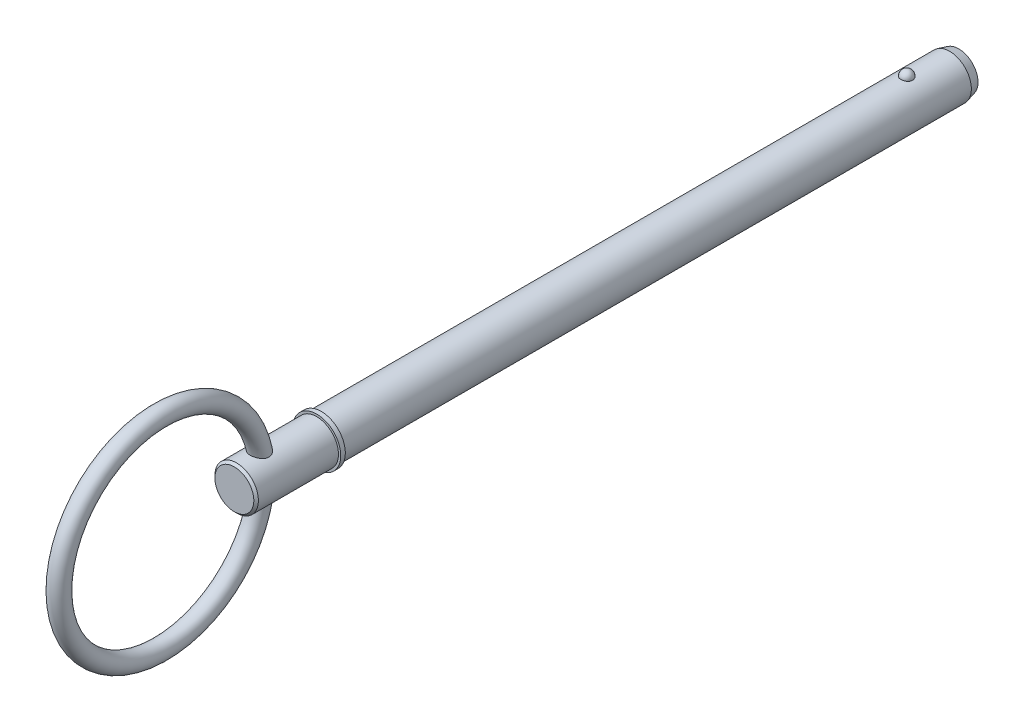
ISO-10303-21;
HEADER;
FILE_DESCRIPTION(('STEP AP214'),'2;1');
FILE_NAME('part.step','',(''),(''),'','','');
FILE_SCHEMA(('AUTOMOTIVE_DESIGN { 1 0 10303 214 1 1 1 1 }'));
ENDSEC;
DATA;
#1=APPLICATION_CONTEXT('core data for automotive mechanical design processes');
#2=APPLICATION_PROTOCOL_DEFINITION('international standard','automotive_design',2000,#1);
#3=PRODUCT_CONTEXT('',#1,'mechanical');
#4=PRODUCT('Part','Part','',(#3));
#5=PRODUCT_RELATED_PRODUCT_CATEGORY('part','',(#4));
#6=PRODUCT_DEFINITION_FORMATION('','',#4);
#7=PRODUCT_DEFINITION_CONTEXT('part definition',#1,'design');
#8=PRODUCT_DEFINITION('design','',#6,#7);
#9=PRODUCT_DEFINITION_SHAPE('','',#8);
#10=(LENGTH_UNIT() NAMED_UNIT(*) SI_UNIT(.MILLI.,.METRE.));
#11=(NAMED_UNIT(*) PLANE_ANGLE_UNIT() SI_UNIT($,.RADIAN.));
#12=(NAMED_UNIT(*) SI_UNIT($,.STERADIAN.) SOLID_ANGLE_UNIT());
#13=UNCERTAINTY_MEASURE_WITH_UNIT(LENGTH_MEASURE(1.E-05),#10,'distance_accuracy_value','');
#14=(GEOMETRIC_REPRESENTATION_CONTEXT(3) GLOBAL_UNCERTAINTY_ASSIGNED_CONTEXT((#13)) GLOBAL_UNIT_ASSIGNED_CONTEXT((#10,
#11,#12)) REPRESENTATION_CONTEXT('',''));
#15=CARTESIAN_POINT('',(0.,0.,0.));
#16=DIRECTION('',(0.,0.,1.));
#17=DIRECTION('',(1.,0.,0.));
#18=AXIS2_PLACEMENT_3D('',#15,#16,#17);
#19=CARTESIAN_POINT('',(0.,0.,127.));
#20=DIRECTION('',(0.,0.,-1.));
#21=DIRECTION('',(-1.,0.,0.));
#22=AXIS2_PLACEMENT_3D('',#19,#20,#21);
#23=CYLINDRICAL_SURFACE('',#22,4.765);
#24=CARTESIAN_POINT('',(1.27812710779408,4.59038300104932,-1.28999999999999));
#25=CARTESIAN_POINT('',(1.27812572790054,4.59038414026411,-1.21786886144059));
#26=CARTESIAN_POINT('',(1.27223018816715,4.59203736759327,-1.14572000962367));
#27=CARTESIAN_POINT('',(1.24878929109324,4.59846646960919,-1.00346315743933));
#28=CARTESIAN_POINT('',(1.23123896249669,4.60324367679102,-0.933356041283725));
#29=CARTESIAN_POINT('',(1.18493861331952,4.61537801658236,-0.797215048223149));
#30=CARTESIAN_POINT('',(1.15619354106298,4.62273400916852,-0.731179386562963));
#31=CARTESIAN_POINT('',(1.08822596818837,4.6392032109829,-0.604986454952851));
#32=CARTESIAN_POINT('',(1.04900384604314,4.64831635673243,-0.544828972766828));
#33=CARTESIAN_POINT('',(0.960865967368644,4.66733302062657,-0.431775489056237));
#34=CARTESIAN_POINT('',(0.911906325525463,4.67723999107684,-0.378914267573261));
#35=CARTESIAN_POINT('',(0.805678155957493,4.69670280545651,-0.282245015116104));
#36=CARTESIAN_POINT('',(0.748409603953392,4.70625864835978,-0.238437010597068));
#37=CARTESIAN_POINT('',(0.627266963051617,4.72392767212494,-0.161207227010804));
#38=CARTESIAN_POINT('',(0.563411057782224,4.73204466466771,-0.127757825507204));
#39=CARTESIAN_POINT('',(0.430755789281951,4.74595788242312,-0.0720471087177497));
#40=CARTESIAN_POINT('',(0.361956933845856,4.75175434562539,-0.0497846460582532));
#41=CARTESIAN_POINT('',(0.222605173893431,4.76030056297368,-0.0173750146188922));
#42=CARTESIAN_POINT('',(0.152101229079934,4.76309991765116,-0.00703038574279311));
#43=CARTESIAN_POINT('',(0.0103009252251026,4.76551622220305,0.00191361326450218));
#44=CARTESIAN_POINT('',(-0.0609953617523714,4.76513345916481,0.000514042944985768));
#45=CARTESIAN_POINT('',(-0.201348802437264,4.76125496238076,-0.0138891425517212));
#46=CARTESIAN_POINT('',(-0.270423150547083,4.75780093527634,-0.0267372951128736));
#47=CARTESIAN_POINT('',(-0.405377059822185,4.74820737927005,-0.0634598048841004));
#48=CARTESIAN_POINT('',(-0.471256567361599,4.74206780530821,-0.0873343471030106));
#49=CARTESIAN_POINT('',(-0.598375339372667,4.72771507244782,-0.145611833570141));
#50=CARTESIAN_POINT('',(-0.659587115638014,4.71949070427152,-0.180071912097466));
#51=CARTESIAN_POINT('',(-0.775356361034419,4.70185936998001,-0.258542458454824));
#52=CARTESIAN_POINT('',(-0.8299131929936,4.69245229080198,-0.302553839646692));
#53=CARTESIAN_POINT('',(-0.931895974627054,4.67327936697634,-0.399829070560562));
#54=CARTESIAN_POINT('',(-0.979176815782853,4.66351011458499,-0.453244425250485));
#55=CARTESIAN_POINT('',(-1.06421220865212,4.64484426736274,-0.567321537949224));
#56=CARTESIAN_POINT('',(-1.10196613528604,4.63594772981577,-0.627983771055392));
#57=CARTESIAN_POINT('',(-1.16735225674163,4.61992036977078,-0.755585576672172));
#58=CARTESIAN_POINT('',(-1.19487251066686,4.61280933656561,-0.822585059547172));
#59=CARTESIAN_POINT('',(-1.23851975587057,4.60128324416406,-0.960417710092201));
#60=CARTESIAN_POINT('',(-1.25464705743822,4.59686811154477,-1.03125077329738));
#61=CARTESIAN_POINT('',(-1.27505790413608,4.59124882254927,-1.17443804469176));
#62=CARTESIAN_POINT('',(-1.27938868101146,4.59003186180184,-1.246785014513));
#63=CARTESIAN_POINT('',(-1.27623192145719,4.5909105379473,-1.39119892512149));
#64=CARTESIAN_POINT('',(-1.26874468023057,4.59300609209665,-1.46326587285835));
#65=CARTESIAN_POINT('',(-1.24220427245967,4.60025423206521,-1.60473192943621));
#66=CARTESIAN_POINT('',(-1.2232043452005,4.60539274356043,-1.67414176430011));
#67=CARTESIAN_POINT('',(-1.17415910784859,4.61813957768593,-1.80870154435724));
#68=CARTESIAN_POINT('',(-1.1441133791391,4.62574799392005,-1.87385132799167));
#69=CARTESIAN_POINT('',(-1.07354327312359,4.64263368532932,-1.99841604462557));
#70=CARTESIAN_POINT('',(-1.03296580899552,4.65191934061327,-2.05779976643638));
#71=CARTESIAN_POINT('',(-0.942433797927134,4.67110036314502,-2.16881966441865));
#72=CARTESIAN_POINT('',(-0.892478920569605,4.68099575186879,-2.22045556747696));
#73=CARTESIAN_POINT('',(-0.784302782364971,4.70033161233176,-2.31471696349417));
#74=CARTESIAN_POINT('',(-0.726054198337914,4.70977043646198,-2.35731146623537));
#75=CARTESIAN_POINT('',(-0.602997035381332,4.72709995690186,-2.43206620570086));
#76=CARTESIAN_POINT('',(-0.538188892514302,4.73499075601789,-2.46422713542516));
#77=CARTESIAN_POINT('',(-0.404639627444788,4.7482563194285,-2.5168745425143));
#78=CARTESIAN_POINT('',(-0.335953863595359,4.7536596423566,-2.53749415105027));
#79=CARTESIAN_POINT('',(-0.195948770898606,4.76148510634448,-2.5670372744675));
#80=CARTESIAN_POINT('',(-0.124629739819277,4.76390758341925,-2.5759621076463));
#81=CARTESIAN_POINT('',(0.0172696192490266,4.76548774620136,-2.5818033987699));
#82=CARTESIAN_POINT('',(0.0878407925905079,4.76470225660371,-2.57892886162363));
#83=CARTESIAN_POINT('',(0.227467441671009,4.76008019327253,-2.561726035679));
#84=CARTESIAN_POINT('',(0.296522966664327,4.75624371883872,-2.5473981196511));
#85=CARTESIAN_POINT('',(0.430942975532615,4.74595041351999,-2.50776251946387));
#86=CARTESIAN_POINT('',(0.496319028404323,4.7395023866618,-2.4824917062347));
#87=CARTESIAN_POINT('',(0.621860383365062,4.72467083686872,-2.42167301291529));
#88=CARTESIAN_POINT('',(0.682025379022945,4.71628720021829,-2.38612452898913));
#89=CARTESIAN_POINT('',(0.796409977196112,4.69833598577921,-2.30511163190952));
#90=CARTESIAN_POINT('',(0.850529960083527,4.68875291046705,-2.25951003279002));
#91=CARTESIAN_POINT('',(0.950412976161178,4.66953243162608,-2.15992428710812));
#92=CARTESIAN_POINT('',(0.996174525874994,4.65989501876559,-2.1059386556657));
#93=CARTESIAN_POINT('',(1.07885962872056,4.64145616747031,-1.99009376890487));
#94=CARTESIAN_POINT('',(1.11562789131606,4.63267081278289,-1.92812106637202));
#95=CARTESIAN_POINT('',(1.17840570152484,4.61710269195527,-1.79873681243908));
#96=CARTESIAN_POINT('',(1.20441973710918,4.61031909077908,-1.73132754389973));
#97=CARTESIAN_POINT('',(1.24242116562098,4.60021170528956,-1.60192906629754));
#98=CARTESIAN_POINT('',(1.25578772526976,4.59655387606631,-1.54036674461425));
#99=CARTESIAN_POINT('',(1.27364121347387,4.59163904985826,-1.41587409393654));
#100=CARTESIAN_POINT('',(1.2781283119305,4.59038200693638,-1.35294379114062));
#101=CARTESIAN_POINT('',(1.27812710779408,4.59038300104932,-1.28999999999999));
#102=B_SPLINE_CURVE_WITH_KNOTS('',3,(#24,#25,#26,#27,#28,#29,#30,#31,#32,#33,#34,#35,#36,#37,
#38,#39,#40,#41,#42,#43,#44,#45,#46,#47,#48,#49,#50,#51,#52,#53,#54,#55,#56,#57,#58,#59,#60,#61,
#62,#63,#64,#65,#66,#67,#68,#69,#70,#71,#72,#73,#74,#75,#76,#77,#78,#79,#80,#81,#82,#83,#84,#85,
#86,#87,#88,#89,#90,#91,#92,#93,#94,#95,#96,#97,#98,#99,#100,#101),.UNSPECIFIED.,.T.,.F.,(4,2,2,
2,2,2,2,2,2,2,2,2,2,2,2,2,2,2,2,2,2,2,2,2,2,2,2,2,2,2,2,2,2,2,2,2,2,2,4),(0.,0.216167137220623,
0.432426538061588,0.648590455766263,0.864746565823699,1.0818998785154,1.29905382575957,
1.51562361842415,1.73217119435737,1.94507683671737,2.15796327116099,2.36800220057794,
2.57804465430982,2.78924132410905,3.00045819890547,3.21545551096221,3.43046692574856,
3.64776550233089,3.8650581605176,4.08147951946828,4.29789547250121,4.51331818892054,
4.72874907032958,4.94528769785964,5.16183395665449,5.37911087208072,5.59637335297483,
5.8110751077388,6.02575265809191,6.23664413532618,6.44752874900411,6.65770827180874,
6.86790014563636,7.08116060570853,7.29445887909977,7.51121476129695,7.72788009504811,
7.91651762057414,8.10515153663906),.UNSPECIFIED.);
#103=CARTESIAN_POINT('',(1.27812710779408,4.59038300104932,-1.28999999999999));
#104=VERTEX_POINT('',#103);
#105=EDGE_CURVE('E102',#104,#104,#102,.T.);
#106=ORIENTED_EDGE('',*,*,#105,.T.);
#107=EDGE_LOOP('',(#106));
#108=FACE_BOUND('',#107,.T.);
#109=CARTESIAN_POINT('',(0.,0.,-10.6999999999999));
#110=DIRECTION('',(0.,0.,-1.));
#111=DIRECTION('',(-1.,0.,0.));
#112=AXIS2_PLACEMENT_3D('',#109,#110,#111);
#113=CIRCLE('',#112,4.765);
#114=CARTESIAN_POINT('',(-4.765,0.,-10.6999999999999));
#115=VERTEX_POINT('',#114);
#116=EDGE_CURVE('E109',#115,#115,#113,.F.);
#117=ORIENTED_EDGE('',*,*,#116,.T.);
#118=EDGE_LOOP('',(#117));
#119=FACE_BOUND('',#118,.T.);
#120=CARTESIAN_POINT('',(0.,0.,127.));
#121=DIRECTION('',(0.,0.,1.));
#122=DIRECTION('',(1.,0.,0.));
#123=AXIS2_PLACEMENT_3D('',#120,#121,#122);
#124=CIRCLE('',#123,4.765);
#125=CARTESIAN_POINT('',(4.765,0.,127.));
#126=VERTEX_POINT('',#125);
#127=EDGE_CURVE('E107',#126,#126,#124,.T.);
#128=ORIENTED_EDGE('',*,*,#127,.F.);
#129=EDGE_LOOP('',(#128));
#130=FACE_BOUND('',#129,.T.);
#131=ADVANCED_FACE('F39',(#108,#119,#130),#23,.T.);
#132=CARTESIAN_POINT('',(0.,0.,-12.7));
#133=DIRECTION('',(0.,0.,-1.));
#134=DIRECTION('',(-1.,0.,0.));
#135=AXIS2_PLACEMENT_3D('',#132,#133,#134);
#136=PLANE('',#135);
#137=CARTESIAN_POINT('',(0.,0.,-12.7));
#138=DIRECTION('',(0.,0.,-1.));
#139=DIRECTION('',(-1.,0.,0.));
#140=AXIS2_PLACEMENT_3D('',#137,#138,#139);
#141=CIRCLE('',#140,4.22910161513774);
#142=CARTESIAN_POINT('',(-4.22910161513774,0.,-12.7));
#143=VERTEX_POINT('',#142);
#144=EDGE_CURVE('E142',#143,#143,#141,.T.);
#145=ORIENTED_EDGE('',*,*,#144,.T.);
#146=EDGE_LOOP('',(#145));
#147=FACE_BOUND('',#146,.T.);
#148=ADVANCED_FACE('F88',(#147),#136,.T.);
#149=CARTESIAN_POINT('',(0.,0.,-12.7));
#150=DIRECTION('',(0.,0.,1.));
#151=DIRECTION('',(1.,0.,0.));
#152=AXIS2_PLACEMENT_3D('',#149,#150,#151);
#153=CONICAL_SURFACE('',#152,4.22910161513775,0.261799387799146);
#154=ORIENTED_EDGE('',*,*,#116,.F.);
#155=EDGE_LOOP('',(#154));
#156=FACE_BOUND('',#155,.T.);
#157=ORIENTED_EDGE('',*,*,#144,.F.);
#158=EDGE_LOOP('',(#157));
#159=FACE_BOUND('',#158,.T.);
#160=ADVANCED_FACE('F94',(#156,#159),#153,.T.);
#161=CARTESIAN_POINT('',(0.,4.765,-1.28999999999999));
#162=DIRECTION('',(0.,1.,0.));
#163=DIRECTION('',(0.,0.,-1.));
#164=AXIS2_PLACEMENT_3D('',#161,#162,#163);
#165=SPHERICAL_SURFACE('',#164,1.29);
#166=ORIENTED_EDGE('',*,*,#105,.F.);
#167=EDGE_LOOP('',(#166));
#168=FACE_BOUND('',#167,.T.);
#169=ADVANCED_FACE('F112',(#168),#165,.T.);
#170=CARTESIAN_POINT('',(0.,0.,127.));
#171=DIRECTION('',(0.,0.,-1.));
#172=DIRECTION('',(-1.,0.,0.));
#173=AXIS2_PLACEMENT_3D('',#170,#171,#172);
#174=PLANE('',#173);
#175=ORIENTED_EDGE('',*,*,#127,.T.);
#176=EDGE_LOOP('',(#175));
#177=FACE_BOUND('',#176,.T.);
#178=CARTESIAN_POINT('',(0.,0.,127.));
#179=DIRECTION('',(0.,0.,-1.));
#180=DIRECTION('',(-1.,0.,0.));
#181=AXIS2_PLACEMENT_3D('',#178,#179,#180);
#182=CIRCLE('',#181,5.265);
#183=CARTESIAN_POINT('',(-5.265,0.,127.));
#184=VERTEX_POINT('',#183);
#185=EDGE_CURVE('E108',#184,#184,#182,.T.);
#186=ORIENTED_EDGE('',*,*,#185,.T.);
#187=EDGE_LOOP('',(#186));
#188=FACE_BOUND('',#187,.T.);
#189=ADVANCED_FACE('F116',(#177,#188),#174,.T.);
#190=CARTESIAN_POINT('',(0.,0.,33.7287874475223));
#191=DIRECTION('',(0.,0.,-1.));
#192=DIRECTION('',(-1.,0.,0.));
#193=AXIS2_PLACEMENT_3D('',#190,#191,#192);
#194=CYLINDRICAL_SURFACE('',#193,5.265);
#195=CARTESIAN_POINT('',(0.,0.,128.));
#196=DIRECTION('',(0.,0.,-1.));
#197=DIRECTION('',(-1.,0.,0.));
#198=AXIS2_PLACEMENT_3D('',#195,#196,#197);
#199=CIRCLE('',#198,5.265);
#200=CARTESIAN_POINT('',(-5.265,0.,128.));
#201=VERTEX_POINT('',#200);
#202=EDGE_CURVE('E133',#201,#201,#199,.T.);
#203=ORIENTED_EDGE('',*,*,#202,.T.);
#204=EDGE_LOOP('',(#203));
#205=FACE_BOUND('',#204,.T.);
#206=ORIENTED_EDGE('',*,*,#185,.F.);
#207=EDGE_LOOP('',(#206));
#208=FACE_BOUND('',#207,.T.);
#209=ADVANCED_FACE('F120',(#205,#208),#194,.T.);
#210=CARTESIAN_POINT('',(0.,5.265,128.));
#211=DIRECTION('',(0.,0.,1.));
#212=DIRECTION('',(1.,0.,0.));
#213=AXIS2_PLACEMENT_3D('',#210,#211,#212);
#214=PLANE('',#213);
#215=CARTESIAN_POINT('',(0.,0.,128.));
#216=DIRECTION('',(0.,0.,1.));
#217=DIRECTION('',(1.,0.,0.));
#218=AXIS2_PLACEMENT_3D('',#215,#216,#217);
#219=CIRCLE('',#218,4.765);
#220=CARTESIAN_POINT('',(4.765,0.,128.));
#221=VERTEX_POINT('',#220);
#222=EDGE_CURVE('E111',#221,#221,#219,.T.);
#223=ORIENTED_EDGE('',*,*,#222,.F.);
#224=EDGE_LOOP('',(#223));
#225=FACE_BOUND('',#224,.T.);
#226=ORIENTED_EDGE('',*,*,#202,.F.);
#227=EDGE_LOOP('',(#226));
#228=FACE_BOUND('',#227,.T.);
#229=ADVANCED_FACE('F85',(#225,#228),#214,.T.);
#230=CARTESIAN_POINT('',(0.,0.,146.05));
#231=DIRECTION('',(0.,0.,-1.));
#232=DIRECTION('',(-1.,0.,0.));
#233=AXIS2_PLACEMENT_3D('',#230,#231,#232);
#234=CYLINDRICAL_SURFACE('',#233,4.765);
#235=CARTESIAN_POINT('',(-1.17603588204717,-4.61759294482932,138.88372006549));
#236=CARTESIAN_POINT('',(-1.08605054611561,-4.6405075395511,138.8215688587));
#237=CARTESIAN_POINT('',(-0.990486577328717,-4.66202408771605,138.76673933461));
#238=CARTESIAN_POINT('',(-0.790762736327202,-4.70002969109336,138.672995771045));
#239=CARTESIAN_POINT('',(-0.686587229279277,-4.7165093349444,138.634111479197));
#240=CARTESIAN_POINT('',(-0.472539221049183,-4.7427361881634,138.573267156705));
#241=CARTESIAN_POINT('',(-0.362665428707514,-4.7524818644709,138.551310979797));
#242=CARTESIAN_POINT('',(-0.140482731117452,-4.7642267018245,138.524936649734));
#243=CARTESIAN_POINT('',(-0.0281752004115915,-4.7662301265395,138.520508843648));
#244=CARTESIAN_POINT('',(0.193745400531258,-4.76233166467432,138.529208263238));
#245=CARTESIAN_POINT('',(0.303372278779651,-4.75656024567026,138.542045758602));
#246=CARTESIAN_POINT('',(0.518724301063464,-4.73791484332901,138.584434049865));
#247=CARTESIAN_POINT('',(0.624448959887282,-4.72503997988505,138.613986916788));
#248=CARTESIAN_POINT('',(0.829434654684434,-4.69340588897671,138.68920858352));
#249=CARTESIAN_POINT('',(0.928674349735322,-4.6746283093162,138.734927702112));
#250=CARTESIAN_POINT('',(1.11777413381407,-4.6330539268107,138.841473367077));
#251=CARTESIAN_POINT('',(1.20763216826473,-4.61025624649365,138.902303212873));
#252=CARTESIAN_POINT('',(1.37762760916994,-4.56238439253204,139.039439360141));
#253=CARTESIAN_POINT('',(1.45749020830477,-4.53726959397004,139.11607281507));
#254=CARTESIAN_POINT('',(1.60275140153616,-4.48801828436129,139.282293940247));
#255=CARTESIAN_POINT('',(1.66815155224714,-4.46388166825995,139.371880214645));
#256=CARTESIAN_POINT('',(1.78162069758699,-4.41980966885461,139.560468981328));
#257=CARTESIAN_POINT('',(1.82993675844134,-4.3998162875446,139.659308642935));
#258=CARTESIAN_POINT('',(1.90902953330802,-4.3660853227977,139.864739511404));
#259=CARTESIAN_POINT('',(1.93981696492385,-4.35234391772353,139.971325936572));
#260=CARTESIAN_POINT('',(1.9818112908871,-4.33337618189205,140.182380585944));
#261=CARTESIAN_POINT('',(1.99406945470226,-4.32769391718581,140.28660066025));
#262=CARTESIAN_POINT('',(2.0025484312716,-4.32377679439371,140.495812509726));
#263=CARTESIAN_POINT('',(1.99876733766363,-4.32554282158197,140.600804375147));
#264=CARTESIAN_POINT('',(1.97595504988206,-4.33600911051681,140.809105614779));
#265=CARTESIAN_POINT('',(1.95686739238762,-4.3447350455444,140.912407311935));
#266=CARTESIAN_POINT('',(1.90457346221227,-4.36790947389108,141.114679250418));
#267=CARTESIAN_POINT('',(1.87136191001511,-4.38236010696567,141.213647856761));
#268=CARTESIAN_POINT('',(1.78747856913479,-4.4172881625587,141.416470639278));
#269=CARTESIAN_POINT('',(1.73524632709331,-4.43826528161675,141.519592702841));
#270=CARTESIAN_POINT('',(1.61607256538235,-4.48303292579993,141.716386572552));
#271=CARTESIAN_POINT('',(1.54911576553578,-4.50682636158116,141.810048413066));
#272=CARTESIAN_POINT('',(1.39359064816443,-4.55746895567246,141.995383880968));
#273=CARTESIAN_POINT('',(1.30346928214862,-4.5843706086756,142.085750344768));
#274=CARTESIAN_POINT('',(1.10794390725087,-4.63549850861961,142.249011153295));
#275=CARTESIAN_POINT('',(1.00255934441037,-4.65972809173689,142.321927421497));
#276=CARTESIAN_POINT('',(0.803761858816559,-4.69755503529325,142.432407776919));
#277=CARTESIAN_POINT('',(0.712935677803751,-4.71231838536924,142.474230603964));
#278=CARTESIAN_POINT('',(0.525172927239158,-4.73691370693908,142.542936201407));
#279=CARTESIAN_POINT('',(0.428242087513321,-4.7467502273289,142.569832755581));
#280=CARTESIAN_POINT('',(0.230351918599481,-4.76046566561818,142.607147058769));
#281=CARTESIAN_POINT('',(0.129376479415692,-4.76431768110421,142.617490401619));
#282=CARTESIAN_POINT('',(-0.0728965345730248,-4.76551495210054,142.620716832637));
#283=CARTESIAN_POINT('',(-0.174194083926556,-4.76286070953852,142.61360126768));
#284=CARTESIAN_POINT('',(-0.366467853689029,-4.751792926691,142.583579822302));
#285=CARTESIAN_POINT('',(-0.457659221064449,-4.74381187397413,142.561858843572));
#286=CARTESIAN_POINT('',(-0.635226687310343,-4.72331548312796,142.505084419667));
#287=CARTESIAN_POINT('',(-0.721601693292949,-4.71079912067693,142.470027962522));
#288=CARTESIAN_POINT('',(-0.893212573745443,-4.68139468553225,142.385559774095));
#289=CARTESIAN_POINT('',(-0.978027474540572,-4.66427939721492,142.335377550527));
#290=CARTESIAN_POINT('',(-1.13917803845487,-4.62756330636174,142.223642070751));
#291=CARTESIAN_POINT('',(-1.21550961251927,-4.6079613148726,142.162083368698));
#292=CARTESIAN_POINT('',(-1.37033540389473,-4.56452178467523,142.01868852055));
#293=CARTESIAN_POINT('',(-1.44723650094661,-4.5405070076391,141.935184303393));
#294=CARTESIAN_POINT('',(-1.58763850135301,-4.49334232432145,141.757292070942));
#295=CARTESIAN_POINT('',(-1.65112672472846,-4.47019325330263,141.662893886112));
#296=CARTESIAN_POINT('',(-1.77033243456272,-4.42444393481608,141.453206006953));
#297=CARTESIAN_POINT('',(-1.82420433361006,-4.40224259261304,141.336768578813));
#298=CARTESIAN_POINT('',(-1.91169086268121,-4.36496831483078,141.095409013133));
#299=CARTESIAN_POINT('',(-1.94531523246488,-4.34989195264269,140.970490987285));
#300=CARTESIAN_POINT('',(-1.98892523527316,-4.33012255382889,140.722016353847));
#301=CARTESIAN_POINT('',(-1.99998275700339,-4.32495941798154,140.598689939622));
#302=CARTESIAN_POINT('',(-2.00001713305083,-4.32494814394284,140.352073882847));
#303=CARTESIAN_POINT('',(-1.98902141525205,-4.33008719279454,140.228784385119));
#304=CARTESIAN_POINT('',(-1.94752572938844,-4.34888267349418,140.00321378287));
#305=CARTESIAN_POINT('',(-1.9197975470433,-4.36132278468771,139.900310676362));
#306=CARTESIAN_POINT('',(-1.84805595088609,-4.39220107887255,139.701251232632));
#307=CARTESIAN_POINT('',(-1.80403476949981,-4.4106421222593,139.605098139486));
#308=CARTESIAN_POINT('',(-1.7023200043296,-4.4508689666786,139.424457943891));
#309=CARTESIAN_POINT('',(-1.64499853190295,-4.47255887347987,139.339738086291));
#310=CARTESIAN_POINT('',(-1.51770958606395,-4.51733419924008,139.181012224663));
#311=CARTESIAN_POINT('',(-1.44776268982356,-4.54041730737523,139.106989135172));
#312=CARTESIAN_POINT('',(-1.34143544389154,-4.57239833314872,139.01104340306));
#313=CARTESIAN_POINT('',(-1.30955259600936,-4.58164274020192,138.984115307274));
#314=CARTESIAN_POINT('',(-1.24406394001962,-4.59985727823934,138.932340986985));
#315=CARTESIAN_POINT('',(-1.21045807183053,-4.6088273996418,138.90749483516));
#316=CARTESIAN_POINT('',(-1.17603588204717,-4.61759294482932,138.88372006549));
#317=B_SPLINE_CURVE_WITH_KNOTS('',3,(#235,#236,#237,#238,#239,#240,#241,#242,#243,#244,#245,
#246,#247,#248,#249,#250,#251,#252,#253,#254,#255,#256,#257,#258,#259,#260,#261,#262,#263,#264,
#265,#266,#267,#268,#269,#270,#271,#272,#273,#274,#275,#276,#277,#278,#279,#280,#281,#282,#283,
#284,#285,#286,#287,#288,#289,#290,#291,#292,#293,#294,#295,#296,#297,#298,#299,#300,#301,#302,
#303,#304,#305,#306,#307,#308,#309,#310,#311,#312,#313,#314,#315,#316),.UNSPECIFIED.,.T.,.F.,(4,
2,2,2,2,2,2,2,2,2,2,2,2,2,2,2,2,2,2,2,2,2,2,2,2,2,2,2,2,2,2,2,2,2,2,2,2,2,2,2,4),(0.,
0.335054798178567,0.670731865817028,1.00648532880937,1.34205386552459,1.67206089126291,
2.00210881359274,2.33319321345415,2.66434996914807,3.00321157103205,3.34203668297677,
3.67573940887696,4.00923787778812,4.32299322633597,4.63678586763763,4.95174139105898,
5.26681474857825,5.61785759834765,5.96926647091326,6.35862694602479,6.74749565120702,
7.04947204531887,7.35116911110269,7.65421852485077,7.95724456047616,8.23825252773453,
8.51932400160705,8.81825171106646,9.11732288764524,9.46404422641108,9.81109188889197,
10.1997682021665,10.5882573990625,10.9578189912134,11.32692124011,11.6472091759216,
11.9676500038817,12.2800235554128,12.5918925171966,12.7200569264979,12.8482258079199),.UNSPECIFIED.);
#318=CARTESIAN_POINT('',(-1.17603588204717,-4.61759294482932,138.88372006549));
#319=VERTEX_POINT('',#318);
#320=EDGE_CURVE('E10',#319,#319,#317,.T.);
#321=ORIENTED_EDGE('',*,*,#320,.F.);
#322=EDGE_LOOP('',(#321));
#323=FACE_BOUND('',#322,.T.);
#324=CARTESIAN_POINT('',(-1.17603588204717,4.61759294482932,138.88372006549));
#325=CARTESIAN_POINT('',(-1.26499234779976,4.59493450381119,138.945169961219));
#326=CARTESIAN_POINT('',(-1.34870034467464,4.57085993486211,139.013915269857));
#327=CARTESIAN_POINT('',(-1.50334626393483,4.52236448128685,139.164635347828));
#328=CARTESIAN_POINT('',(-1.57425996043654,4.49794303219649,139.24663466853));
#329=CARTESIAN_POINT('',(-1.70130187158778,4.45144771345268,139.422234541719));
#330=CARTESIAN_POINT('',(-1.75740699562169,4.42937754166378,139.51585288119));
#331=CARTESIAN_POINT('',(-1.8528775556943,4.3903018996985,139.7121668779));
#332=CARTESIAN_POINT('',(-1.89225871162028,4.37329167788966,139.814853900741));
#333=CARTESIAN_POINT('',(-1.95188661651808,4.34699775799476,140.021857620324));
#334=CARTESIAN_POINT('',(-1.97286468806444,4.33742068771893,140.125926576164));
#335=CARTESIAN_POINT('',(-1.99814509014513,4.32583397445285,140.336471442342));
#336=CARTESIAN_POINT('',(-2.00244696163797,4.32382453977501,140.442947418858));
#337=CARTESIAN_POINT('',(-1.9949990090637,4.32726361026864,140.652770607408));
#338=CARTESIAN_POINT('',(-1.98360617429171,4.33254625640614,140.756134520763));
#339=CARTESIAN_POINT('',(-1.94643618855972,4.34936983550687,140.959691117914));
#340=CARTESIAN_POINT('',(-1.92065444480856,4.3609127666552,141.059882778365));
#341=CARTESIAN_POINT('',(-1.85292379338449,4.3901452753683,141.26410420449));
#342=CARTESIAN_POINT('',(-1.80971134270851,4.40830066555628,141.367646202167));
#343=CARTESIAN_POINT('',(-1.7089274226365,4.44833985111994,141.566768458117));
#344=CARTESIAN_POINT('',(-1.6513428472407,4.4702270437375,141.662341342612));
#345=CARTESIAN_POINT('',(-1.51475300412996,4.51847764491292,141.855260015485));
#346=CARTESIAN_POINT('',(-1.43395667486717,4.54505660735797,141.951291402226));
#347=CARTESIAN_POINT('',(-1.25684082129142,4.59718102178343,142.128132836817));
#348=CARTESIAN_POINT('',(-1.16053129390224,4.62272712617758,142.208952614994));
#349=CARTESIAN_POINT('',(-0.972192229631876,4.66558476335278,142.339326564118));
#350=CARTESIAN_POINT('',(-0.882391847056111,4.68355428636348,142.391879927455));
#351=CARTESIAN_POINT('',(-0.694836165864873,4.71502283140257,142.482022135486));
#352=CARTESIAN_POINT('',(-0.597087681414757,4.72852563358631,142.519623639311));
#353=CARTESIAN_POINT('',(-0.395321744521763,4.74966109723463,142.577875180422));
#354=CARTESIAN_POINT('',(-0.291269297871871,4.75725698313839,142.598419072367));
#355=CARTESIAN_POINT('',(-0.0808979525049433,4.76547327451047,142.620624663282));
#356=CARTESIAN_POINT('',(0.0254198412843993,4.76609700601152,142.62229536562));
#357=CARTESIAN_POINT('',(0.225327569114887,4.7606097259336,142.607485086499));
#358=CARTESIAN_POINT('',(0.319084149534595,4.75519734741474,142.592887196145));
#359=CARTESIAN_POINT('',(0.502750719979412,4.73930039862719,142.549397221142));
#360=CARTESIAN_POINT('',(0.59266009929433,4.72881502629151,142.520502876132));
#361=CARTESIAN_POINT('',(0.768777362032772,4.70343779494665,142.44904136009));
#362=CARTESIAN_POINT('',(0.854839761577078,4.68844387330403,142.406155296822));
#363=CARTESIAN_POINT('',(1.01943666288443,4.65543047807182,142.308746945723));
#364=CARTESIAN_POINT('',(1.09796821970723,4.63740982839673,142.254220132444));
#365=CARTESIAN_POINT('',(1.2575182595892,4.59691257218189,142.126465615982));
#366=CARTESIAN_POINT('',(1.33721103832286,4.57417011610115,142.051667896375));
#367=CARTESIAN_POINT('',(1.48461190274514,4.52847869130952,141.891082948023));
#368=CARTESIAN_POINT('',(1.55230949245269,4.50552956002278,141.805286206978));
#369=CARTESIAN_POINT('',(1.68366050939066,4.45825797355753,141.611404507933));
#370=CARTESIAN_POINT('',(1.74532014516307,4.4342153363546,141.501889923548));
#371=CARTESIAN_POINT('',(1.85007805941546,4.39154308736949,141.273269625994));
#372=CARTESIAN_POINT('',(1.89317429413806,4.37291407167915,141.154162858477));
#373=CARTESIAN_POINT('',(1.958572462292,4.34402041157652,140.909763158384));
#374=CARTESIAN_POINT('',(1.98095022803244,4.33372528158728,140.784494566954));
#375=CARTESIAN_POINT('',(2.00301292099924,4.32358016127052,140.531594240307));
#376=CARTESIAN_POINT('',(2.00273000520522,4.32371536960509,140.403966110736));
#377=CARTESIAN_POINT('',(1.9799756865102,4.3341693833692,140.168247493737));
#378=CARTESIAN_POINT('',(1.96044562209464,4.34313814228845,140.059806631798));
#379=CARTESIAN_POINT('',(1.90368145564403,4.36831534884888,139.848543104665));
#380=CARTESIAN_POINT('',(1.86644884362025,4.38452318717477,139.745719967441));
#381=CARTESIAN_POINT('',(1.77811542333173,4.42104679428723,139.55471002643));
#382=CARTESIAN_POINT('',(1.7279770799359,4.44105894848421,139.466015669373));
#383=CARTESIAN_POINT('',(1.61439500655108,4.48359504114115,139.298286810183));
#384=CARTESIAN_POINT('',(1.55094927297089,4.50611935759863,139.219253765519));
#385=CARTESIAN_POINT('',(1.40889349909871,4.55259151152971,139.068705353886));
#386=CARTESIAN_POINT('',(1.32968750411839,4.57655455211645,138.997757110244));
#387=CARTESIAN_POINT('',(1.16035884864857,4.62238936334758,138.869506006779));
#388=CARTESIAN_POINT('',(1.07023361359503,4.64426063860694,138.81220637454));
#389=CARTESIAN_POINT('',(0.877362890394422,4.68460759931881,138.710316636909));
#390=CARTESIAN_POINT('',(0.774249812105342,4.70290564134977,138.666349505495));
#391=CARTESIAN_POINT('',(0.561430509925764,4.73302876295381,138.595484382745));
#392=CARTESIAN_POINT('',(0.451725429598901,4.74485496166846,138.568583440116));
#393=CARTESIAN_POINT('',(0.230282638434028,4.76071009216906,138.532763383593));
#394=CARTESIAN_POINT('',(0.118587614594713,4.76483485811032,138.523623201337));
#395=CARTESIAN_POINT('',(-0.10491160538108,4.76515532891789,138.522908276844));
#396=CARTESIAN_POINT('',(-0.216715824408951,4.76134861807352,138.531338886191));
#397=CARTESIAN_POINT('',(-0.435231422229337,4.74632552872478,138.56524563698));
#398=CARTESIAN_POINT('',(-0.541996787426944,4.73523460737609,138.590433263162));
#399=CARTESIAN_POINT('',(-0.749371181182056,4.70686626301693,138.656921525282));
#400=CARTESIAN_POINT('',(-0.849990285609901,4.68959930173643,138.698194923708));
#401=CARTESIAN_POINT('',(-0.986108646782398,4.66202614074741,138.767235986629));
#402=CARTESIAN_POINT('',(-1.02525769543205,4.65355983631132,138.788772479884));
#403=CARTESIAN_POINT('',(-1.10191286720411,4.63600664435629,138.834367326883));
#404=CARTESIAN_POINT('',(-1.13941901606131,4.62691976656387,138.858425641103));
#405=CARTESIAN_POINT('',(-1.17603588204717,4.61759294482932,138.88372006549));
#406=B_SPLINE_CURVE_WITH_KNOTS('',3,(#324,#325,#326,#327,#328,#329,#330,#331,#332,#333,#334,
#335,#336,#337,#338,#339,#340,#341,#342,#343,#344,#345,#346,#347,#348,#349,#350,#351,#352,#353,
#354,#355,#356,#357,#358,#359,#360,#361,#362,#363,#364,#365,#366,#367,#368,#369,#370,#371,#372,
#373,#374,#375,#376,#377,#378,#379,#380,#381,#382,#383,#384,#385,#386,#387,#388,#389,#390,#391,
#392,#393,#394,#395,#396,#397,#398,#399,#400,#401,#402,#403,#404,#405),.UNSPECIFIED.,.T.,.F.,(4,
2,2,2,2,2,2,2,2,2,2,2,2,2,2,2,2,2,2,2,2,2,2,2,2,2,2,2,2,2,2,2,2,2,2,2,2,2,2,2,4),(0.,
0.331234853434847,0.663090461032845,0.99546050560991,1.3275174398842,1.64568783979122,
1.96386699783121,2.27492717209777,2.5860866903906,2.92571998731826,3.26566413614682,
3.64875195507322,4.03159388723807,4.34706664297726,4.66227172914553,4.97942386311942,
5.29642469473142,5.58021908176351,5.86405835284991,6.15488068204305,6.44581627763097,
6.77943874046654,7.11335170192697,7.4954566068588,7.8776035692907,8.25834622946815,
8.63854860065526,8.96843568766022,9.29829501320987,9.6084287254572,9.91860916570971,
10.2441707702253,10.5698092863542,10.9089029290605,11.2479379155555,11.5827251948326,
11.9176144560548,12.2468820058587,12.5755944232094,12.7119417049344,12.8482868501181),.UNSPECIFIED.);
#407=CARTESIAN_POINT('',(-1.17603588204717,4.61759294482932,138.88372006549));
#408=VERTEX_POINT('',#407);
#409=EDGE_CURVE('E51',#408,#408,#406,.T.);
#410=ORIENTED_EDGE('',*,*,#409,.F.);
#411=EDGE_LOOP('',(#410));
#412=FACE_BOUND('',#411,.T.);
#413=CARTESIAN_POINT('',(0.,0.,145.55));
#414=DIRECTION('',(0.,0.,-1.));
#415=DIRECTION('',(-1.,0.,0.));
#416=AXIS2_PLACEMENT_3D('',#413,#414,#415);
#417=CIRCLE('',#416,4.765);
#418=CARTESIAN_POINT('',(-4.765,0.,145.55));
#419=VERTEX_POINT('',#418);
#420=EDGE_CURVE('E64',#419,#419,#417,.T.);
#421=ORIENTED_EDGE('',*,*,#420,.T.);
#422=EDGE_LOOP('',(#421));
#423=FACE_BOUND('',#422,.T.);
#424=ORIENTED_EDGE('',*,*,#222,.T.);
#425=EDGE_LOOP('',(#424));
#426=FACE_BOUND('',#425,.T.);
#427=ADVANCED_FACE('F69',(#323,#412,#423,#426),#234,.T.);
#428=CARTESIAN_POINT('',(0.,0.,146.05));
#429=DIRECTION('',(0.,0.,-1.));
#430=DIRECTION('',(-1.,0.,0.));
#431=AXIS2_PLACEMENT_3D('',#428,#429,#430);
#432=PLANE('',#431);
#433=CARTESIAN_POINT('',(0.,0.,146.05));
#434=DIRECTION('',(0.,0.,-1.));
#435=DIRECTION('',(-1.,0.,0.));
#436=AXIS2_PLACEMENT_3D('',#433,#434,#435);
#437=CIRCLE('',#436,4.26499999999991);
#438=CARTESIAN_POINT('',(-4.26499999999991,0.,146.05));
#439=VERTEX_POINT('',#438);
#440=EDGE_CURVE('E57',#439,#439,#437,.F.);
#441=ORIENTED_EDGE('',*,*,#440,.T.);
#442=EDGE_LOOP('',(#441));
#443=FACE_BOUND('',#442,.T.);
#444=ADVANCED_FACE('F76',(#443),#432,.F.);
#445=CARTESIAN_POINT('',(0.,0.,145.55));
#446=DIRECTION('',(0.,0.,-1.));
#447=DIRECTION('',(-1.,0.,0.));
#448=AXIS2_PLACEMENT_3D('',#445,#446,#447);
#449=CONICAL_SURFACE('',#448,4.765,0.785398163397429);
#450=ORIENTED_EDGE('',*,*,#440,.F.);
#451=EDGE_LOOP('',(#450));
#452=FACE_BOUND('',#451,.T.);
#453=ORIENTED_EDGE('',*,*,#420,.F.);
#454=EDGE_LOOP('',(#453));
#455=FACE_BOUND('',#454,.T.);
#456=ADVANCED_FACE('F41',(#452,#455),#449,.T.);
#457=CARTESIAN_POINT('',(0.,0.,162.275));
#458=DIRECTION('',(1.,0.,0.));
#459=DIRECTION('',(0.,0.,-1.));
#460=AXIS2_PLACEMENT_3D('',#457,#458,#459);
#461=TOROIDAL_SURFACE('',#460,22.225,2.);
#462=ORIENTED_EDGE('',*,*,#320,.T.);
#463=EDGE_LOOP('',(#462));
#464=FACE_BOUND('',#463,.T.);
#465=ORIENTED_EDGE('',*,*,#409,.T.);
#466=EDGE_LOOP('',(#465));
#467=FACE_BOUND('',#466,.T.);
#468=ADVANCED_FACE('F73',(#464,#467),#461,.T.);
#469=CLOSED_SHELL('',(#131,#148,#160,#169,#189,#209,#229,#427,#444,#456,#468));
#470=MANIFOLD_SOLID_BREP('B2',#469);
#471=ADVANCED_BREP_SHAPE_REPRESENTATION('',(#18,#470),#14);
#472=SHAPE_DEFINITION_REPRESENTATION(#9,#471);
ENDSEC;
END-ISO-10303-21;
